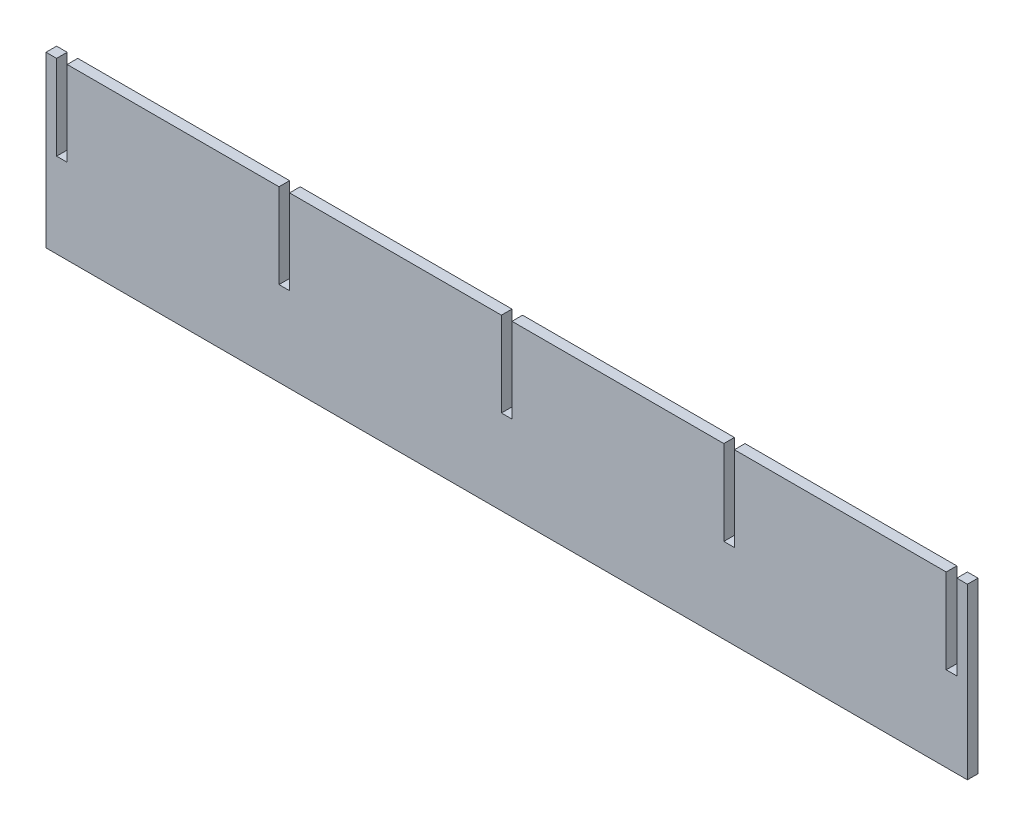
ISO-10303-21;
HEADER;
FILE_DESCRIPTION(('STEP AP214'),'2;1');
FILE_NAME('part.step','',(''),(''),'','','');
FILE_SCHEMA(('AUTOMOTIVE_DESIGN { 1 0 10303 214 1 1 1 1 }'));
ENDSEC;
DATA;
#1=APPLICATION_CONTEXT('core data for automotive mechanical design processes');
#2=APPLICATION_PROTOCOL_DEFINITION('international standard','automotive_design',2000,#1);
#3=PRODUCT_CONTEXT('',#1,'mechanical');
#4=PRODUCT('Part','Part','',(#3));
#5=PRODUCT_RELATED_PRODUCT_CATEGORY('part','',(#4));
#6=PRODUCT_DEFINITION_FORMATION('','',#4);
#7=PRODUCT_DEFINITION_CONTEXT('part definition',#1,'design');
#8=PRODUCT_DEFINITION('design','',#6,#7);
#9=PRODUCT_DEFINITION_SHAPE('','',#8);
#10=(LENGTH_UNIT() NAMED_UNIT(*) SI_UNIT(.MILLI.,.METRE.));
#11=(NAMED_UNIT(*) PLANE_ANGLE_UNIT() SI_UNIT($,.RADIAN.));
#12=(NAMED_UNIT(*) SI_UNIT($,.STERADIAN.) SOLID_ANGLE_UNIT());
#13=UNCERTAINTY_MEASURE_WITH_UNIT(LENGTH_MEASURE(1.E-05),#10,'distance_accuracy_value','');
#14=(GEOMETRIC_REPRESENTATION_CONTEXT(3) GLOBAL_UNCERTAINTY_ASSIGNED_CONTEXT((#13)) GLOBAL_UNIT_ASSIGNED_CONTEXT((#10,
#11,#12)) REPRESENTATION_CONTEXT('',''));
#15=CARTESIAN_POINT('',(0.,0.,0.));
#16=DIRECTION('',(0.,0.,1.));
#17=DIRECTION('',(1.,0.,0.));
#18=AXIS2_PLACEMENT_3D('',#15,#16,#17);
#19=CARTESIAN_POINT('',(984.25,0.,6.35));
#20=DIRECTION('',(0.,1.,0.));
#21=DIRECTION('',(0.,0.,1.));
#22=AXIS2_PLACEMENT_3D('',#19,#20,#21);
#23=PLANE('',#22);
#24=DIRECTION('',(1.,0.,0.));
#25=VECTOR('',#24,1.);
#26=CARTESIAN_POINT('',(984.25,0.,0.));
#27=LINE('',#26,#25);
#28=CARTESIAN_POINT('',(431.8,0.,0.));
#29=VERTEX_POINT('',#28);
#30=CARTESIAN_POINT('',(984.25,0.,0.));
#31=VERTEX_POINT('',#30);
#32=EDGE_CURVE('E230',#29,#31,#27,.T.);
#33=ORIENTED_EDGE('',*,*,#32,.T.);
#34=DIRECTION('',(0.,0.,-1.));
#35=VECTOR('',#34,1.);
#36=CARTESIAN_POINT('',(984.25,0.,6.35));
#37=LINE('',#36,#35);
#38=CARTESIAN_POINT('',(984.25,0.,6.35));
#39=VERTEX_POINT('',#38);
#40=EDGE_CURVE('E11',#39,#31,#37,.T.);
#41=ORIENTED_EDGE('',*,*,#40,.F.);
#42=DIRECTION('',(1.,0.,0.));
#43=VECTOR('',#42,1.);
#44=CARTESIAN_POINT('',(984.25,0.,6.35));
#45=LINE('',#44,#43);
#46=CARTESIAN_POINT('',(431.8,0.,6.35));
#47=VERTEX_POINT('',#46);
#48=EDGE_CURVE('E276',#47,#39,#45,.T.);
#49=ORIENTED_EDGE('',*,*,#48,.F.);
#50=DIRECTION('',(0.,0.,-1.));
#51=VECTOR('',#50,1.);
#52=CARTESIAN_POINT('',(431.8,0.,6.35));
#53=LINE('',#52,#51);
#54=EDGE_CURVE('E226',#47,#29,#53,.T.);
#55=ORIENTED_EDGE('',*,*,#54,.T.);
#56=EDGE_LOOP('',(#33,#41,#49,#55));
#57=FACE_BOUND('',#56,.T.);
#58=ADVANCED_FACE('F38',(#57),#23,.F.);
#59=CARTESIAN_POINT('',(984.25,101.6,6.35));
#60=DIRECTION('',(-1.,0.,0.));
#61=DIRECTION('',(0.,0.,1.));
#62=AXIS2_PLACEMENT_3D('',#59,#60,#61);
#63=PLANE('',#62);
#64=DIRECTION('',(0.,1.,0.));
#65=VECTOR('',#64,1.);
#66=CARTESIAN_POINT('',(984.25,101.6,0.));
#67=LINE('',#66,#65);
#68=CARTESIAN_POINT('',(984.25,101.6,0.));
#69=VERTEX_POINT('',#68);
#70=EDGE_CURVE('E233',#31,#69,#67,.T.);
#71=ORIENTED_EDGE('',*,*,#70,.T.);
#72=DIRECTION('',(0.,0.,-1.));
#73=VECTOR('',#72,1.);
#74=CARTESIAN_POINT('',(984.25,101.6,6.35));
#75=LINE('',#74,#73);
#76=CARTESIAN_POINT('',(984.25,101.6,6.35));
#77=VERTEX_POINT('',#76);
#78=EDGE_CURVE('E46',#77,#69,#75,.T.);
#79=ORIENTED_EDGE('',*,*,#78,.F.);
#80=DIRECTION('',(0.,1.,0.));
#81=VECTOR('',#80,1.);
#82=CARTESIAN_POINT('',(984.25,101.6,6.35));
#83=LINE('',#82,#81);
#84=EDGE_CURVE('E145',#39,#77,#83,.T.);
#85=ORIENTED_EDGE('',*,*,#84,.F.);
#86=ORIENTED_EDGE('',*,*,#40,.T.);
#87=EDGE_LOOP('',(#71,#79,#85,#86));
#88=FACE_BOUND('',#87,.T.);
#89=ADVANCED_FACE('F414',(#88),#63,.F.);
#90=CARTESIAN_POINT('',(977.9,101.6,6.35));
#91=DIRECTION('',(0.,-1.,0.));
#92=DIRECTION('',(0.,0.,-1.));
#93=AXIS2_PLACEMENT_3D('',#90,#91,#92);
#94=PLANE('',#93);
#95=DIRECTION('',(-1.,0.,0.));
#96=VECTOR('',#95,1.);
#97=CARTESIAN_POINT('',(977.9,101.6,0.));
#98=LINE('',#97,#96);
#99=CARTESIAN_POINT('',(977.9,101.6,0.));
#100=VERTEX_POINT('',#99);
#101=EDGE_CURVE('E235',#69,#100,#98,.T.);
#102=ORIENTED_EDGE('',*,*,#101,.T.);
#103=DIRECTION('',(0.,0.,-1.));
#104=VECTOR('',#103,1.);
#105=CARTESIAN_POINT('',(977.9,101.6,6.35));
#106=LINE('',#105,#104);
#107=CARTESIAN_POINT('',(977.9,101.6,6.35));
#108=VERTEX_POINT('',#107);
#109=EDGE_CURVE('E331',#108,#100,#106,.T.);
#110=ORIENTED_EDGE('',*,*,#109,.F.);
#111=DIRECTION('',(-1.,0.,0.));
#112=VECTOR('',#111,1.);
#113=CARTESIAN_POINT('',(977.9,101.6,6.35));
#114=LINE('',#113,#112);
#115=EDGE_CURVE('E339',#77,#108,#114,.T.);
#116=ORIENTED_EDGE('',*,*,#115,.F.);
#117=ORIENTED_EDGE('',*,*,#78,.T.);
#118=EDGE_LOOP('',(#102,#110,#116,#117));
#119=FACE_BOUND('',#118,.T.);
#120=ADVANCED_FACE('F337',(#119),#94,.F.);
#121=CARTESIAN_POINT('',(977.9,50.8,6.35));
#122=DIRECTION('',(1.,0.,0.));
#123=DIRECTION('',(0.,0.,-1.));
#124=AXIS2_PLACEMENT_3D('',#121,#122,#123);
#125=PLANE('',#124);
#126=DIRECTION('',(0.,-1.,0.));
#127=VECTOR('',#126,1.);
#128=CARTESIAN_POINT('',(977.9,50.8,0.));
#129=LINE('',#128,#127);
#130=CARTESIAN_POINT('',(977.9,50.8,0.));
#131=VERTEX_POINT('',#130);
#132=EDGE_CURVE('E237',#100,#131,#129,.T.);
#133=ORIENTED_EDGE('',*,*,#132,.T.);
#134=DIRECTION('',(0.,0.,-1.));
#135=VECTOR('',#134,1.);
#136=CARTESIAN_POINT('',(977.9,50.8,6.35));
#137=LINE('',#136,#135);
#138=CARTESIAN_POINT('',(977.9,50.8,6.35));
#139=VERTEX_POINT('',#138);
#140=EDGE_CURVE('E328',#139,#131,#137,.T.);
#141=ORIENTED_EDGE('',*,*,#140,.F.);
#142=DIRECTION('',(0.,-1.,0.));
#143=VECTOR('',#142,1.);
#144=CARTESIAN_POINT('',(977.9,50.8,6.35));
#145=LINE('',#144,#143);
#146=EDGE_CURVE('E357',#108,#139,#145,.T.);
#147=ORIENTED_EDGE('',*,*,#146,.F.);
#148=ORIENTED_EDGE('',*,*,#109,.T.);
#149=EDGE_LOOP('',(#133,#141,#147,#148));
#150=FACE_BOUND('',#149,.T.);
#151=ADVANCED_FACE('F348',(#150),#125,.F.);
#152=CARTESIAN_POINT('',(971.55,50.8,6.35));
#153=DIRECTION('',(0.,-1.,0.));
#154=DIRECTION('',(0.,0.,-1.));
#155=AXIS2_PLACEMENT_3D('',#152,#153,#154);
#156=PLANE('',#155);
#157=DIRECTION('',(-1.,0.,0.));
#158=VECTOR('',#157,1.);
#159=CARTESIAN_POINT('',(971.55,50.8,0.));
#160=LINE('',#159,#158);
#161=CARTESIAN_POINT('',(971.55,50.8,0.));
#162=VERTEX_POINT('',#161);
#163=EDGE_CURVE('E239',#131,#162,#160,.T.);
#164=ORIENTED_EDGE('',*,*,#163,.T.);
#165=DIRECTION('',(0.,0.,-1.));
#166=VECTOR('',#165,1.);
#167=CARTESIAN_POINT('',(971.55,50.8,6.35));
#168=LINE('',#167,#166);
#169=CARTESIAN_POINT('',(971.55,50.8,6.35));
#170=VERTEX_POINT('',#169);
#171=EDGE_CURVE('E325',#170,#162,#168,.T.);
#172=ORIENTED_EDGE('',*,*,#171,.F.);
#173=DIRECTION('',(-1.,0.,0.));
#174=VECTOR('',#173,1.);
#175=CARTESIAN_POINT('',(971.55,50.8,6.35));
#176=LINE('',#175,#174);
#177=EDGE_CURVE('E354',#139,#170,#176,.T.);
#178=ORIENTED_EDGE('',*,*,#177,.F.);
#179=ORIENTED_EDGE('',*,*,#140,.T.);
#180=EDGE_LOOP('',(#164,#172,#178,#179));
#181=FACE_BOUND('',#180,.T.);
#182=ADVANCED_FACE('F352',(#181),#156,.F.);
#183=CARTESIAN_POINT('',(971.55,101.6,6.35));
#184=DIRECTION('',(-1.,0.,0.));
#185=DIRECTION('',(0.,0.,1.));
#186=AXIS2_PLACEMENT_3D('',#183,#184,#185);
#187=PLANE('',#186);
#188=DIRECTION('',(0.,1.,0.));
#189=VECTOR('',#188,1.);
#190=CARTESIAN_POINT('',(971.55,101.6,0.));
#191=LINE('',#190,#189);
#192=CARTESIAN_POINT('',(971.55,101.6,0.));
#193=VERTEX_POINT('',#192);
#194=EDGE_CURVE('E241',#162,#193,#191,.T.);
#195=ORIENTED_EDGE('',*,*,#194,.T.);
#196=DIRECTION('',(0.,0.,-1.));
#197=VECTOR('',#196,1.);
#198=CARTESIAN_POINT('',(971.55,101.6,6.35));
#199=LINE('',#198,#197);
#200=CARTESIAN_POINT('',(971.55,101.6,6.35));
#201=VERTEX_POINT('',#200);
#202=EDGE_CURVE('E322',#201,#193,#199,.T.);
#203=ORIENTED_EDGE('',*,*,#202,.F.);
#204=DIRECTION('',(0.,1.,0.));
#205=VECTOR('',#204,1.);
#206=CARTESIAN_POINT('',(971.55,101.6,6.35));
#207=LINE('',#206,#205);
#208=EDGE_CURVE('E356',#170,#201,#207,.T.);
#209=ORIENTED_EDGE('',*,*,#208,.F.);
#210=ORIENTED_EDGE('',*,*,#171,.T.);
#211=EDGE_LOOP('',(#195,#203,#209,#210));
#212=FACE_BOUND('',#211,.T.);
#213=ADVANCED_FACE('F427',(#212),#187,.F.);
#214=CARTESIAN_POINT('',(844.55,101.6,6.35));
#215=DIRECTION('',(0.,-1.,0.));
#216=DIRECTION('',(0.,0.,-1.));
#217=AXIS2_PLACEMENT_3D('',#214,#215,#216);
#218=PLANE('',#217);
#219=DIRECTION('',(-1.,0.,0.));
#220=VECTOR('',#219,1.);
#221=CARTESIAN_POINT('',(844.55,101.6,0.));
#222=LINE('',#221,#220);
#223=CARTESIAN_POINT('',(844.55,101.6,0.));
#224=VERTEX_POINT('',#223);
#225=EDGE_CURVE('E243',#193,#224,#222,.T.);
#226=ORIENTED_EDGE('',*,*,#225,.T.);
#227=DIRECTION('',(0.,0.,-1.));
#228=VECTOR('',#227,1.);
#229=CARTESIAN_POINT('',(844.55,101.6,6.35));
#230=LINE('',#229,#228);
#231=CARTESIAN_POINT('',(844.55,101.6,6.35));
#232=VERTEX_POINT('',#231);
#233=EDGE_CURVE('E319',#232,#224,#230,.T.);
#234=ORIENTED_EDGE('',*,*,#233,.F.);
#235=DIRECTION('',(-1.,0.,0.));
#236=VECTOR('',#235,1.);
#237=CARTESIAN_POINT('',(844.55,101.6,6.35));
#238=LINE('',#237,#236);
#239=EDGE_CURVE('E359',#201,#232,#238,.T.);
#240=ORIENTED_EDGE('',*,*,#239,.F.);
#241=ORIENTED_EDGE('',*,*,#202,.T.);
#242=EDGE_LOOP('',(#226,#234,#240,#241));
#243=FACE_BOUND('',#242,.T.);
#244=ADVANCED_FACE('F430',(#243),#218,.F.);
#245=CARTESIAN_POINT('',(844.55,50.8,6.35));
#246=DIRECTION('',(1.,0.,0.));
#247=DIRECTION('',(0.,0.,-1.));
#248=AXIS2_PLACEMENT_3D('',#245,#246,#247);
#249=PLANE('',#248);
#250=DIRECTION('',(0.,-1.,0.));
#251=VECTOR('',#250,1.);
#252=CARTESIAN_POINT('',(844.55,50.8,0.));
#253=LINE('',#252,#251);
#254=CARTESIAN_POINT('',(844.55,50.8,0.));
#255=VERTEX_POINT('',#254);
#256=EDGE_CURVE('E245',#224,#255,#253,.T.);
#257=ORIENTED_EDGE('',*,*,#256,.T.);
#258=DIRECTION('',(0.,0.,-1.));
#259=VECTOR('',#258,1.);
#260=CARTESIAN_POINT('',(844.55,50.8,6.35));
#261=LINE('',#260,#259);
#262=CARTESIAN_POINT('',(844.55,50.8,6.35));
#263=VERTEX_POINT('',#262);
#264=EDGE_CURVE('E316',#263,#255,#261,.T.);
#265=ORIENTED_EDGE('',*,*,#264,.F.);
#266=DIRECTION('',(0.,-1.,0.));
#267=VECTOR('',#266,1.);
#268=CARTESIAN_POINT('',(844.55,50.8,6.35));
#269=LINE('',#268,#267);
#270=EDGE_CURVE('E365',#232,#263,#269,.T.);
#271=ORIENTED_EDGE('',*,*,#270,.F.);
#272=ORIENTED_EDGE('',*,*,#233,.T.);
#273=EDGE_LOOP('',(#257,#265,#271,#272));
#274=FACE_BOUND('',#273,.T.);
#275=ADVANCED_FACE('F434',(#274),#249,.F.);
#276=CARTESIAN_POINT('',(838.2,50.8,6.35));
#277=DIRECTION('',(0.,-1.,0.));
#278=DIRECTION('',(0.,0.,-1.));
#279=AXIS2_PLACEMENT_3D('',#276,#277,#278);
#280=PLANE('',#279);
#281=DIRECTION('',(-1.,0.,0.));
#282=VECTOR('',#281,1.);
#283=CARTESIAN_POINT('',(838.2,50.8,0.));
#284=LINE('',#283,#282);
#285=CARTESIAN_POINT('',(838.2,50.8,0.));
#286=VERTEX_POINT('',#285);
#287=EDGE_CURVE('E247',#255,#286,#284,.T.);
#288=ORIENTED_EDGE('',*,*,#287,.T.);
#289=DIRECTION('',(0.,0.,-1.));
#290=VECTOR('',#289,1.);
#291=CARTESIAN_POINT('',(838.2,50.8,6.35));
#292=LINE('',#291,#290);
#293=CARTESIAN_POINT('',(838.2,50.8,6.35));
#294=VERTEX_POINT('',#293);
#295=EDGE_CURVE('E313',#294,#286,#292,.T.);
#296=ORIENTED_EDGE('',*,*,#295,.F.);
#297=DIRECTION('',(-1.,0.,0.));
#298=VECTOR('',#297,1.);
#299=CARTESIAN_POINT('',(838.2,50.8,6.35));
#300=LINE('',#299,#298);
#301=EDGE_CURVE('E367',#263,#294,#300,.T.);
#302=ORIENTED_EDGE('',*,*,#301,.F.);
#303=ORIENTED_EDGE('',*,*,#264,.T.);
#304=EDGE_LOOP('',(#288,#296,#302,#303));
#305=FACE_BOUND('',#304,.T.);
#306=ADVANCED_FACE('F438',(#305),#280,.F.);
#307=CARTESIAN_POINT('',(838.2,101.6,6.35));
#308=DIRECTION('',(-1.,0.,0.));
#309=DIRECTION('',(0.,0.,1.));
#310=AXIS2_PLACEMENT_3D('',#307,#308,#309);
#311=PLANE('',#310);
#312=DIRECTION('',(0.,1.,0.));
#313=VECTOR('',#312,1.);
#314=CARTESIAN_POINT('',(838.2,101.6,0.));
#315=LINE('',#314,#313);
#316=CARTESIAN_POINT('',(838.2,101.6,0.));
#317=VERTEX_POINT('',#316);
#318=EDGE_CURVE('E249',#286,#317,#315,.T.);
#319=ORIENTED_EDGE('',*,*,#318,.T.);
#320=DIRECTION('',(0.,0.,-1.));
#321=VECTOR('',#320,1.);
#322=CARTESIAN_POINT('',(838.2,101.6,6.35));
#323=LINE('',#322,#321);
#324=CARTESIAN_POINT('',(838.2,101.6,6.35));
#325=VERTEX_POINT('',#324);
#326=EDGE_CURVE('E310',#325,#317,#323,.T.);
#327=ORIENTED_EDGE('',*,*,#326,.F.);
#328=DIRECTION('',(0.,1.,0.));
#329=VECTOR('',#328,1.);
#330=CARTESIAN_POINT('',(838.2,101.6,6.35));
#331=LINE('',#330,#329);
#332=EDGE_CURVE('E369',#294,#325,#331,.T.);
#333=ORIENTED_EDGE('',*,*,#332,.F.);
#334=ORIENTED_EDGE('',*,*,#295,.T.);
#335=EDGE_LOOP('',(#319,#327,#333,#334));
#336=FACE_BOUND('',#335,.T.);
#337=ADVANCED_FACE('F442',(#336),#311,.F.);
#338=CARTESIAN_POINT('',(711.2,101.6,6.35));
#339=DIRECTION('',(0.,-1.,0.));
#340=DIRECTION('',(0.,0.,-1.));
#341=AXIS2_PLACEMENT_3D('',#338,#339,#340);
#342=PLANE('',#341);
#343=DIRECTION('',(-1.,0.,0.));
#344=VECTOR('',#343,1.);
#345=CARTESIAN_POINT('',(711.2,101.6,0.));
#346=LINE('',#345,#344);
#347=CARTESIAN_POINT('',(711.2,101.6,0.));
#348=VERTEX_POINT('',#347);
#349=EDGE_CURVE('E251',#317,#348,#346,.T.);
#350=ORIENTED_EDGE('',*,*,#349,.T.);
#351=DIRECTION('',(0.,0.,-1.));
#352=VECTOR('',#351,1.);
#353=CARTESIAN_POINT('',(711.2,101.6,6.35));
#354=LINE('',#353,#352);
#355=CARTESIAN_POINT('',(711.2,101.6,6.35));
#356=VERTEX_POINT('',#355);
#357=EDGE_CURVE('E307',#356,#348,#354,.T.);
#358=ORIENTED_EDGE('',*,*,#357,.F.);
#359=DIRECTION('',(-1.,0.,0.));
#360=VECTOR('',#359,1.);
#361=CARTESIAN_POINT('',(711.2,101.6,6.35));
#362=LINE('',#361,#360);
#363=EDGE_CURVE('E371',#325,#356,#362,.T.);
#364=ORIENTED_EDGE('',*,*,#363,.F.);
#365=ORIENTED_EDGE('',*,*,#326,.T.);
#366=EDGE_LOOP('',(#350,#358,#364,#365));
#367=FACE_BOUND('',#366,.T.);
#368=ADVANCED_FACE('F446',(#367),#342,.F.);
#369=CARTESIAN_POINT('',(711.2,50.8,6.35));
#370=DIRECTION('',(1.,0.,0.));
#371=DIRECTION('',(0.,0.,-1.));
#372=AXIS2_PLACEMENT_3D('',#369,#370,#371);
#373=PLANE('',#372);
#374=DIRECTION('',(0.,-1.,0.));
#375=VECTOR('',#374,1.);
#376=CARTESIAN_POINT('',(711.2,50.8,0.));
#377=LINE('',#376,#375);
#378=CARTESIAN_POINT('',(711.2,50.8,0.));
#379=VERTEX_POINT('',#378);
#380=EDGE_CURVE('E253',#348,#379,#377,.T.);
#381=ORIENTED_EDGE('',*,*,#380,.T.);
#382=DIRECTION('',(0.,0.,-1.));
#383=VECTOR('',#382,1.);
#384=CARTESIAN_POINT('',(711.2,50.8,6.35));
#385=LINE('',#384,#383);
#386=CARTESIAN_POINT('',(711.2,50.8,6.35));
#387=VERTEX_POINT('',#386);
#388=EDGE_CURVE('E304',#387,#379,#385,.T.);
#389=ORIENTED_EDGE('',*,*,#388,.F.);
#390=DIRECTION('',(0.,-1.,0.));
#391=VECTOR('',#390,1.);
#392=CARTESIAN_POINT('',(711.2,50.8,6.35));
#393=LINE('',#392,#391);
#394=EDGE_CURVE('E373',#356,#387,#393,.T.);
#395=ORIENTED_EDGE('',*,*,#394,.F.);
#396=ORIENTED_EDGE('',*,*,#357,.T.);
#397=EDGE_LOOP('',(#381,#389,#395,#396));
#398=FACE_BOUND('',#397,.T.);
#399=ADVANCED_FACE('F450',(#398),#373,.F.);
#400=CARTESIAN_POINT('',(704.85,50.8,6.35));
#401=DIRECTION('',(0.,-1.,0.));
#402=DIRECTION('',(0.,0.,-1.));
#403=AXIS2_PLACEMENT_3D('',#400,#401,#402);
#404=PLANE('',#403);
#405=DIRECTION('',(-1.,0.,0.));
#406=VECTOR('',#405,1.);
#407=CARTESIAN_POINT('',(704.85,50.8,0.));
#408=LINE('',#407,#406);
#409=CARTESIAN_POINT('',(704.85,50.8,0.));
#410=VERTEX_POINT('',#409);
#411=EDGE_CURVE('E255',#379,#410,#408,.T.);
#412=ORIENTED_EDGE('',*,*,#411,.T.);
#413=DIRECTION('',(0.,0.,-1.));
#414=VECTOR('',#413,1.);
#415=CARTESIAN_POINT('',(704.85,50.8,6.35));
#416=LINE('',#415,#414);
#417=CARTESIAN_POINT('',(704.85,50.8,6.35));
#418=VERTEX_POINT('',#417);
#419=EDGE_CURVE('E301',#418,#410,#416,.T.);
#420=ORIENTED_EDGE('',*,*,#419,.F.);
#421=DIRECTION('',(-1.,0.,0.));
#422=VECTOR('',#421,1.);
#423=CARTESIAN_POINT('',(704.85,50.8,6.35));
#424=LINE('',#423,#422);
#425=EDGE_CURVE('E375',#387,#418,#424,.T.);
#426=ORIENTED_EDGE('',*,*,#425,.F.);
#427=ORIENTED_EDGE('',*,*,#388,.T.);
#428=EDGE_LOOP('',(#412,#420,#426,#427));
#429=FACE_BOUND('',#428,.T.);
#430=ADVANCED_FACE('F454',(#429),#404,.F.);
#431=CARTESIAN_POINT('',(704.85,101.6,6.35));
#432=DIRECTION('',(-1.,0.,0.));
#433=DIRECTION('',(0.,0.,1.));
#434=AXIS2_PLACEMENT_3D('',#431,#432,#433);
#435=PLANE('',#434);
#436=DIRECTION('',(0.,1.,0.));
#437=VECTOR('',#436,1.);
#438=CARTESIAN_POINT('',(704.85,101.6,0.));
#439=LINE('',#438,#437);
#440=CARTESIAN_POINT('',(704.85,101.6,0.));
#441=VERTEX_POINT('',#440);
#442=EDGE_CURVE('E257',#410,#441,#439,.T.);
#443=ORIENTED_EDGE('',*,*,#442,.T.);
#444=DIRECTION('',(0.,0.,-1.));
#445=VECTOR('',#444,1.);
#446=CARTESIAN_POINT('',(704.85,101.6,6.35));
#447=LINE('',#446,#445);
#448=CARTESIAN_POINT('',(704.85,101.6,6.35));
#449=VERTEX_POINT('',#448);
#450=EDGE_CURVE('E298',#449,#441,#447,.T.);
#451=ORIENTED_EDGE('',*,*,#450,.F.);
#452=DIRECTION('',(0.,1.,0.));
#453=VECTOR('',#452,1.);
#454=CARTESIAN_POINT('',(704.85,101.6,6.35));
#455=LINE('',#454,#453);
#456=EDGE_CURVE('E377',#418,#449,#455,.T.);
#457=ORIENTED_EDGE('',*,*,#456,.F.);
#458=ORIENTED_EDGE('',*,*,#419,.T.);
#459=EDGE_LOOP('',(#443,#451,#457,#458));
#460=FACE_BOUND('',#459,.T.);
#461=ADVANCED_FACE('F458',(#460),#435,.F.);
#462=CARTESIAN_POINT('',(577.85,101.6,6.35));
#463=DIRECTION('',(0.,-1.,0.));
#464=DIRECTION('',(0.,0.,-1.));
#465=AXIS2_PLACEMENT_3D('',#462,#463,#464);
#466=PLANE('',#465);
#467=DIRECTION('',(-1.,0.,0.));
#468=VECTOR('',#467,1.);
#469=CARTESIAN_POINT('',(577.85,101.6,0.));
#470=LINE('',#469,#468);
#471=CARTESIAN_POINT('',(577.85,101.6,0.));
#472=VERTEX_POINT('',#471);
#473=EDGE_CURVE('E259',#441,#472,#470,.T.);
#474=ORIENTED_EDGE('',*,*,#473,.T.);
#475=DIRECTION('',(0.,0.,-1.));
#476=VECTOR('',#475,1.);
#477=CARTESIAN_POINT('',(577.85,101.6,6.35));
#478=LINE('',#477,#476);
#479=CARTESIAN_POINT('',(577.85,101.6,6.35));
#480=VERTEX_POINT('',#479);
#481=EDGE_CURVE('E295',#480,#472,#478,.T.);
#482=ORIENTED_EDGE('',*,*,#481,.F.);
#483=DIRECTION('',(-1.,0.,0.));
#484=VECTOR('',#483,1.);
#485=CARTESIAN_POINT('',(577.85,101.6,6.35));
#486=LINE('',#485,#484);
#487=EDGE_CURVE('E379',#449,#480,#486,.T.);
#488=ORIENTED_EDGE('',*,*,#487,.F.);
#489=ORIENTED_EDGE('',*,*,#450,.T.);
#490=EDGE_LOOP('',(#474,#482,#488,#489));
#491=FACE_BOUND('',#490,.T.);
#492=ADVANCED_FACE('F462',(#491),#466,.F.);
#493=CARTESIAN_POINT('',(577.85,50.8,6.35));
#494=DIRECTION('',(1.,0.,0.));
#495=DIRECTION('',(0.,0.,-1.));
#496=AXIS2_PLACEMENT_3D('',#493,#494,#495);
#497=PLANE('',#496);
#498=DIRECTION('',(0.,-1.,0.));
#499=VECTOR('',#498,1.);
#500=CARTESIAN_POINT('',(577.85,50.8,0.));
#501=LINE('',#500,#499);
#502=CARTESIAN_POINT('',(577.85,50.8,0.));
#503=VERTEX_POINT('',#502);
#504=EDGE_CURVE('E261',#472,#503,#501,.T.);
#505=ORIENTED_EDGE('',*,*,#504,.T.);
#506=DIRECTION('',(0.,0.,-1.));
#507=VECTOR('',#506,1.);
#508=CARTESIAN_POINT('',(577.85,50.8,6.35));
#509=LINE('',#508,#507);
#510=CARTESIAN_POINT('',(577.85,50.8,6.35));
#511=VERTEX_POINT('',#510);
#512=EDGE_CURVE('E292',#511,#503,#509,.T.);
#513=ORIENTED_EDGE('',*,*,#512,.F.);
#514=DIRECTION('',(0.,-1.,0.));
#515=VECTOR('',#514,1.);
#516=CARTESIAN_POINT('',(577.85,50.8,6.35));
#517=LINE('',#516,#515);
#518=EDGE_CURVE('E381',#480,#511,#517,.T.);
#519=ORIENTED_EDGE('',*,*,#518,.F.);
#520=ORIENTED_EDGE('',*,*,#481,.T.);
#521=EDGE_LOOP('',(#505,#513,#519,#520));
#522=FACE_BOUND('',#521,.T.);
#523=ADVANCED_FACE('F466',(#522),#497,.F.);
#524=CARTESIAN_POINT('',(571.5,50.8,6.35));
#525=DIRECTION('',(0.,-1.,0.));
#526=DIRECTION('',(0.,0.,-1.));
#527=AXIS2_PLACEMENT_3D('',#524,#525,#526);
#528=PLANE('',#527);
#529=DIRECTION('',(-1.,0.,0.));
#530=VECTOR('',#529,1.);
#531=CARTESIAN_POINT('',(571.5,50.8,0.));
#532=LINE('',#531,#530);
#533=CARTESIAN_POINT('',(571.5,50.8,0.));
#534=VERTEX_POINT('',#533);
#535=EDGE_CURVE('E263',#503,#534,#532,.T.);
#536=ORIENTED_EDGE('',*,*,#535,.T.);
#537=DIRECTION('',(0.,0.,-1.));
#538=VECTOR('',#537,1.);
#539=CARTESIAN_POINT('',(571.5,50.8,6.35));
#540=LINE('',#539,#538);
#541=CARTESIAN_POINT('',(571.5,50.8,6.35));
#542=VERTEX_POINT('',#541);
#543=EDGE_CURVE('E289',#542,#534,#540,.T.);
#544=ORIENTED_EDGE('',*,*,#543,.F.);
#545=DIRECTION('',(-1.,0.,0.));
#546=VECTOR('',#545,1.);
#547=CARTESIAN_POINT('',(571.5,50.8,6.35));
#548=LINE('',#547,#546);
#549=EDGE_CURVE('E383',#511,#542,#548,.T.);
#550=ORIENTED_EDGE('',*,*,#549,.F.);
#551=ORIENTED_EDGE('',*,*,#512,.T.);
#552=EDGE_LOOP('',(#536,#544,#550,#551));
#553=FACE_BOUND('',#552,.T.);
#554=ADVANCED_FACE('F470',(#553),#528,.F.);
#555=CARTESIAN_POINT('',(571.5,101.6,6.35));
#556=DIRECTION('',(-1.,0.,0.));
#557=DIRECTION('',(0.,0.,1.));
#558=AXIS2_PLACEMENT_3D('',#555,#556,#557);
#559=PLANE('',#558);
#560=DIRECTION('',(0.,1.,0.));
#561=VECTOR('',#560,1.);
#562=CARTESIAN_POINT('',(571.5,101.6,0.));
#563=LINE('',#562,#561);
#564=CARTESIAN_POINT('',(571.5,101.6,0.));
#565=VERTEX_POINT('',#564);
#566=EDGE_CURVE('E265',#534,#565,#563,.T.);
#567=ORIENTED_EDGE('',*,*,#566,.T.);
#568=DIRECTION('',(0.,0.,-1.));
#569=VECTOR('',#568,1.);
#570=CARTESIAN_POINT('',(571.5,101.6,6.35));
#571=LINE('',#570,#569);
#572=CARTESIAN_POINT('',(571.5,101.6,6.35));
#573=VERTEX_POINT('',#572);
#574=EDGE_CURVE('E286',#573,#565,#571,.T.);
#575=ORIENTED_EDGE('',*,*,#574,.F.);
#576=DIRECTION('',(0.,1.,0.));
#577=VECTOR('',#576,1.);
#578=CARTESIAN_POINT('',(571.5,101.6,6.35));
#579=LINE('',#578,#577);
#580=EDGE_CURVE('E385',#542,#573,#579,.T.);
#581=ORIENTED_EDGE('',*,*,#580,.F.);
#582=ORIENTED_EDGE('',*,*,#543,.T.);
#583=EDGE_LOOP('',(#567,#575,#581,#582));
#584=FACE_BOUND('',#583,.T.);
#585=ADVANCED_FACE('F474',(#584),#559,.F.);
#586=CARTESIAN_POINT('',(444.5,101.6,6.35));
#587=DIRECTION('',(0.,-1.,0.));
#588=DIRECTION('',(0.,0.,-1.));
#589=AXIS2_PLACEMENT_3D('',#586,#587,#588);
#590=PLANE('',#589);
#591=DIRECTION('',(-1.,0.,0.));
#592=VECTOR('',#591,1.);
#593=CARTESIAN_POINT('',(444.5,101.6,0.));
#594=LINE('',#593,#592);
#595=CARTESIAN_POINT('',(444.5,101.6,0.));
#596=VERTEX_POINT('',#595);
#597=EDGE_CURVE('E267',#565,#596,#594,.T.);
#598=ORIENTED_EDGE('',*,*,#597,.T.);
#599=DIRECTION('',(0.,0.,-1.));
#600=VECTOR('',#599,1.);
#601=CARTESIAN_POINT('',(444.5,101.6,6.35));
#602=LINE('',#601,#600);
#603=CARTESIAN_POINT('',(444.5,101.6,6.35));
#604=VERTEX_POINT('',#603);
#605=EDGE_CURVE('E283',#604,#596,#602,.T.);
#606=ORIENTED_EDGE('',*,*,#605,.F.);
#607=DIRECTION('',(-1.,0.,0.));
#608=VECTOR('',#607,1.);
#609=CARTESIAN_POINT('',(444.5,101.6,6.35));
#610=LINE('',#609,#608);
#611=EDGE_CURVE('E387',#573,#604,#610,.T.);
#612=ORIENTED_EDGE('',*,*,#611,.F.);
#613=ORIENTED_EDGE('',*,*,#574,.T.);
#614=EDGE_LOOP('',(#598,#606,#612,#613));
#615=FACE_BOUND('',#614,.T.);
#616=ADVANCED_FACE('F478',(#615),#590,.F.);
#617=CARTESIAN_POINT('',(444.5,50.8,6.35));
#618=DIRECTION('',(1.,0.,0.));
#619=DIRECTION('',(0.,0.,-1.));
#620=AXIS2_PLACEMENT_3D('',#617,#618,#619);
#621=PLANE('',#620);
#622=DIRECTION('',(0.,-1.,0.));
#623=VECTOR('',#622,1.);
#624=CARTESIAN_POINT('',(444.5,50.8,0.));
#625=LINE('',#624,#623);
#626=CARTESIAN_POINT('',(444.5,50.8,0.));
#627=VERTEX_POINT('',#626);
#628=EDGE_CURVE('E269',#596,#627,#625,.T.);
#629=ORIENTED_EDGE('',*,*,#628,.T.);
#630=DIRECTION('',(0.,0.,-1.));
#631=VECTOR('',#630,1.);
#632=CARTESIAN_POINT('',(444.5,50.8,6.35));
#633=LINE('',#632,#631);
#634=CARTESIAN_POINT('',(444.5,50.8,6.35));
#635=VERTEX_POINT('',#634);
#636=EDGE_CURVE('E280',#635,#627,#633,.T.);
#637=ORIENTED_EDGE('',*,*,#636,.F.);
#638=DIRECTION('',(0.,-1.,0.));
#639=VECTOR('',#638,1.);
#640=CARTESIAN_POINT('',(444.5,50.8,6.35));
#641=LINE('',#640,#639);
#642=EDGE_CURVE('E389',#604,#635,#641,.T.);
#643=ORIENTED_EDGE('',*,*,#642,.F.);
#644=ORIENTED_EDGE('',*,*,#605,.T.);
#645=EDGE_LOOP('',(#629,#637,#643,#644));
#646=FACE_BOUND('',#645,.T.);
#647=ADVANCED_FACE('F395',(#646),#621,.F.);
#648=CARTESIAN_POINT('',(438.15,50.8,6.35));
#649=DIRECTION('',(0.,-1.,0.));
#650=DIRECTION('',(0.,0.,-1.));
#651=AXIS2_PLACEMENT_3D('',#648,#649,#650);
#652=PLANE('',#651);
#653=DIRECTION('',(-1.,0.,0.));
#654=VECTOR('',#653,1.);
#655=CARTESIAN_POINT('',(438.15,50.8,0.));
#656=LINE('',#655,#654);
#657=CARTESIAN_POINT('',(438.15,50.8,0.));
#658=VERTEX_POINT('',#657);
#659=EDGE_CURVE('E271',#627,#658,#656,.T.);
#660=ORIENTED_EDGE('',*,*,#659,.T.);
#661=DIRECTION('',(0.,0.,-1.));
#662=VECTOR('',#661,1.);
#663=CARTESIAN_POINT('',(438.15,50.8,6.35));
#664=LINE('',#663,#662);
#665=CARTESIAN_POINT('',(438.15,50.8,6.35));
#666=VERTEX_POINT('',#665);
#667=EDGE_CURVE('E221',#666,#658,#664,.T.);
#668=ORIENTED_EDGE('',*,*,#667,.F.);
#669=DIRECTION('',(-1.,0.,0.));
#670=VECTOR('',#669,1.);
#671=CARTESIAN_POINT('',(438.15,50.8,6.35));
#672=LINE('',#671,#670);
#673=EDGE_CURVE('E212',#635,#666,#672,.T.);
#674=ORIENTED_EDGE('',*,*,#673,.F.);
#675=ORIENTED_EDGE('',*,*,#636,.T.);
#676=EDGE_LOOP('',(#660,#668,#674,#675));
#677=FACE_BOUND('',#676,.T.);
#678=ADVANCED_FACE('F399',(#677),#652,.F.);
#679=CARTESIAN_POINT('',(438.15,101.6,6.35));
#680=DIRECTION('',(-1.,0.,0.));
#681=DIRECTION('',(0.,0.,1.));
#682=AXIS2_PLACEMENT_3D('',#679,#680,#681);
#683=PLANE('',#682);
#684=DIRECTION('',(0.,1.,0.));
#685=VECTOR('',#684,1.);
#686=CARTESIAN_POINT('',(438.15,101.6,0.));
#687=LINE('',#686,#685);
#688=CARTESIAN_POINT('',(438.15,101.6,0.));
#689=VERTEX_POINT('',#688);
#690=EDGE_CURVE('E220',#658,#689,#687,.T.);
#691=ORIENTED_EDGE('',*,*,#690,.T.);
#692=DIRECTION('',(0.,0.,-1.));
#693=VECTOR('',#692,1.);
#694=CARTESIAN_POINT('',(438.15,101.6,6.35));
#695=LINE('',#694,#693);
#696=CARTESIAN_POINT('',(438.15,101.6,6.35));
#697=VERTEX_POINT('',#696);
#698=EDGE_CURVE('E217',#697,#689,#695,.T.);
#699=ORIENTED_EDGE('',*,*,#698,.F.);
#700=DIRECTION('',(0.,1.,0.));
#701=VECTOR('',#700,1.);
#702=CARTESIAN_POINT('',(438.15,101.6,6.35));
#703=LINE('',#702,#701);
#704=EDGE_CURVE('E206',#666,#697,#703,.T.);
#705=ORIENTED_EDGE('',*,*,#704,.F.);
#706=ORIENTED_EDGE('',*,*,#667,.T.);
#707=EDGE_LOOP('',(#691,#699,#705,#706));
#708=FACE_BOUND('',#707,.T.);
#709=ADVANCED_FACE('F218',(#708),#683,.F.);
#710=CARTESIAN_POINT('',(431.8,101.6,6.35));
#711=DIRECTION('',(0.,-1.,0.));
#712=DIRECTION('',(0.,0.,-1.));
#713=AXIS2_PLACEMENT_3D('',#710,#711,#712);
#714=PLANE('',#713);
#715=DIRECTION('',(-1.,0.,0.));
#716=VECTOR('',#715,1.);
#717=CARTESIAN_POINT('',(431.8,101.6,0.));
#718=LINE('',#717,#716);
#719=CARTESIAN_POINT('',(431.8,101.6,0.));
#720=VERTEX_POINT('',#719);
#721=EDGE_CURVE('E131',#689,#720,#718,.T.);
#722=ORIENTED_EDGE('',*,*,#721,.T.);
#723=DIRECTION('',(0.,0.,-1.));
#724=VECTOR('',#723,1.);
#725=CARTESIAN_POINT('',(431.8,101.6,6.35));
#726=LINE('',#725,#724);
#727=CARTESIAN_POINT('',(431.8,101.6,6.35));
#728=VERTEX_POINT('',#727);
#729=EDGE_CURVE('E222',#728,#720,#726,.T.);
#730=ORIENTED_EDGE('',*,*,#729,.F.);
#731=DIRECTION('',(-1.,0.,0.));
#732=VECTOR('',#731,1.);
#733=CARTESIAN_POINT('',(431.8,101.6,6.35));
#734=LINE('',#733,#732);
#735=EDGE_CURVE('E210',#697,#728,#734,.T.);
#736=ORIENTED_EDGE('',*,*,#735,.F.);
#737=ORIENTED_EDGE('',*,*,#698,.T.);
#738=EDGE_LOOP('',(#722,#730,#736,#737));
#739=FACE_BOUND('',#738,.T.);
#740=ADVANCED_FACE('F224',(#739),#714,.F.);
#741=CARTESIAN_POINT('',(431.8,0.,6.35));
#742=DIRECTION('',(1.,0.,0.));
#743=DIRECTION('',(0.,0.,-1.));
#744=AXIS2_PLACEMENT_3D('',#741,#742,#743);
#745=PLANE('',#744);
#746=DIRECTION('',(0.,-1.,0.));
#747=VECTOR('',#746,1.);
#748=CARTESIAN_POINT('',(431.8,0.,0.));
#749=LINE('',#748,#747);
#750=EDGE_CURVE('E137',#720,#29,#749,.T.);
#751=ORIENTED_EDGE('',*,*,#750,.T.);
#752=ORIENTED_EDGE('',*,*,#54,.F.);
#753=DIRECTION('',(0.,-1.,0.));
#754=VECTOR('',#753,1.);
#755=CARTESIAN_POINT('',(431.8,0.,6.35));
#756=LINE('',#755,#754);
#757=EDGE_CURVE('E54',#728,#47,#756,.T.);
#758=ORIENTED_EDGE('',*,*,#757,.F.);
#759=ORIENTED_EDGE('',*,*,#729,.T.);
#760=EDGE_LOOP('',(#751,#752,#758,#759));
#761=FACE_BOUND('',#760,.T.);
#762=ADVANCED_FACE('F403',(#761),#745,.F.);
#763=CARTESIAN_POINT('',(0.,0.,6.35));
#764=DIRECTION('',(0.,0.,-1.));
#765=DIRECTION('',(-1.,0.,0.));
#766=AXIS2_PLACEMENT_3D('',#763,#764,#765);
#767=PLANE('',#766);
#768=ORIENTED_EDGE('',*,*,#48,.T.);
#769=ORIENTED_EDGE('',*,*,#84,.T.);
#770=ORIENTED_EDGE('',*,*,#115,.T.);
#771=ORIENTED_EDGE('',*,*,#146,.T.);
#772=ORIENTED_EDGE('',*,*,#177,.T.);
#773=ORIENTED_EDGE('',*,*,#208,.T.);
#774=ORIENTED_EDGE('',*,*,#239,.T.);
#775=ORIENTED_EDGE('',*,*,#270,.T.);
#776=ORIENTED_EDGE('',*,*,#301,.T.);
#777=ORIENTED_EDGE('',*,*,#332,.T.);
#778=ORIENTED_EDGE('',*,*,#363,.T.);
#779=ORIENTED_EDGE('',*,*,#394,.T.);
#780=ORIENTED_EDGE('',*,*,#425,.T.);
#781=ORIENTED_EDGE('',*,*,#456,.T.);
#782=ORIENTED_EDGE('',*,*,#487,.T.);
#783=ORIENTED_EDGE('',*,*,#518,.T.);
#784=ORIENTED_EDGE('',*,*,#549,.T.);
#785=ORIENTED_EDGE('',*,*,#580,.T.);
#786=ORIENTED_EDGE('',*,*,#611,.T.);
#787=ORIENTED_EDGE('',*,*,#642,.T.);
#788=ORIENTED_EDGE('',*,*,#673,.T.);
#789=ORIENTED_EDGE('',*,*,#704,.T.);
#790=ORIENTED_EDGE('',*,*,#735,.T.);
#791=ORIENTED_EDGE('',*,*,#757,.T.);
#792=EDGE_LOOP('',(#768,#769,#770,#771,#772,#773,#774,#775,#776,#777,#778,#779,#780,#781,#782,
#783,#784,#785,#786,#787,#788,#789,#790,#791));
#793=FACE_BOUND('',#792,.T.);
#794=ADVANCED_FACE('F208',(#793),#767,.F.);
#795=CARTESIAN_POINT('',(0.,0.,0.));
#796=DIRECTION('',(0.,0.,-1.));
#797=DIRECTION('',(-1.,0.,0.));
#798=AXIS2_PLACEMENT_3D('',#795,#796,#797);
#799=PLANE('',#798);
#800=ORIENTED_EDGE('',*,*,#32,.F.);
#801=ORIENTED_EDGE('',*,*,#750,.F.);
#802=ORIENTED_EDGE('',*,*,#721,.F.);
#803=ORIENTED_EDGE('',*,*,#690,.F.);
#804=ORIENTED_EDGE('',*,*,#659,.F.);
#805=ORIENTED_EDGE('',*,*,#628,.F.);
#806=ORIENTED_EDGE('',*,*,#597,.F.);
#807=ORIENTED_EDGE('',*,*,#566,.F.);
#808=ORIENTED_EDGE('',*,*,#535,.F.);
#809=ORIENTED_EDGE('',*,*,#504,.F.);
#810=ORIENTED_EDGE('',*,*,#473,.F.);
#811=ORIENTED_EDGE('',*,*,#442,.F.);
#812=ORIENTED_EDGE('',*,*,#411,.F.);
#813=ORIENTED_EDGE('',*,*,#380,.F.);
#814=ORIENTED_EDGE('',*,*,#349,.F.);
#815=ORIENTED_EDGE('',*,*,#318,.F.);
#816=ORIENTED_EDGE('',*,*,#287,.F.);
#817=ORIENTED_EDGE('',*,*,#256,.F.);
#818=ORIENTED_EDGE('',*,*,#225,.F.);
#819=ORIENTED_EDGE('',*,*,#194,.F.);
#820=ORIENTED_EDGE('',*,*,#163,.F.);
#821=ORIENTED_EDGE('',*,*,#132,.F.);
#822=ORIENTED_EDGE('',*,*,#101,.F.);
#823=ORIENTED_EDGE('',*,*,#70,.F.);
#824=EDGE_LOOP('',(#800,#801,#802,#803,#804,#805,#806,#807,#808,#809,#810,#811,#812,#813,#814,
#815,#816,#817,#818,#819,#820,#821,#822,#823));
#825=FACE_BOUND('',#824,.T.);
#826=ADVANCED_FACE('F343',(#825),#799,.T.);
#827=CLOSED_SHELL('',(#58,#89,#120,#151,#182,#213,#244,#275,#306,#337,#368,#399,#430,#461,#492,
#523,#554,#585,#616,#647,#678,#709,#740,#762,#794,#826));
#828=MANIFOLD_SOLID_BREP('B2',#827);
#829=ADVANCED_BREP_SHAPE_REPRESENTATION('',(#18,#828),#14);
#830=SHAPE_DEFINITION_REPRESENTATION(#9,#829);
ENDSEC;
END-ISO-10303-21;
